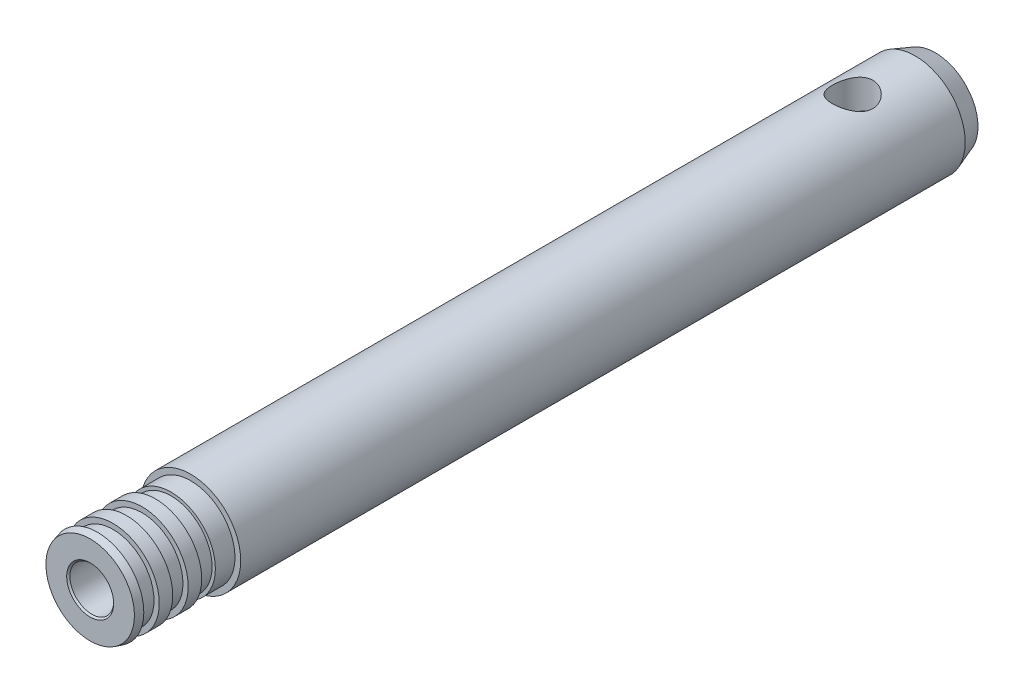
ISO-10303-21;
HEADER;
FILE_DESCRIPTION(('STEP AP214'),'2;1');
FILE_NAME('part.step','',(''),(''),'','','');
FILE_SCHEMA(('AUTOMOTIVE_DESIGN { 1 0 10303 214 1 1 1 1 }'));
ENDSEC;
DATA;
#1=APPLICATION_CONTEXT('core data for automotive mechanical design processes');
#2=APPLICATION_PROTOCOL_DEFINITION('international standard','automotive_design',2000,#1);
#3=PRODUCT_CONTEXT('',#1,'mechanical');
#4=PRODUCT('Part','Part','',(#3));
#5=PRODUCT_RELATED_PRODUCT_CATEGORY('part','',(#4));
#6=PRODUCT_DEFINITION_FORMATION('','',#4);
#7=PRODUCT_DEFINITION_CONTEXT('part definition',#1,'design');
#8=PRODUCT_DEFINITION('design','',#6,#7);
#9=PRODUCT_DEFINITION_SHAPE('','',#8);
#10=(LENGTH_UNIT() NAMED_UNIT(*) SI_UNIT(.MILLI.,.METRE.));
#11=(NAMED_UNIT(*) PLANE_ANGLE_UNIT() SI_UNIT($,.RADIAN.));
#12=(NAMED_UNIT(*) SI_UNIT($,.STERADIAN.) SOLID_ANGLE_UNIT());
#13=UNCERTAINTY_MEASURE_WITH_UNIT(LENGTH_MEASURE(1.E-05),#10,'distance_accuracy_value','');
#14=(GEOMETRIC_REPRESENTATION_CONTEXT(3) GLOBAL_UNCERTAINTY_ASSIGNED_CONTEXT((#13)) GLOBAL_UNIT_ASSIGNED_CONTEXT((#10,
#11,#12)) REPRESENTATION_CONTEXT('',''));
#15=CARTESIAN_POINT('',(0.,0.,0.));
#16=DIRECTION('',(0.,0.,1.));
#17=DIRECTION('',(1.,0.,0.));
#18=AXIS2_PLACEMENT_3D('',#15,#16,#17);
#19=CARTESIAN_POINT('',(0.,0.,66.7385));
#20=DIRECTION('',(0.,0.,1.));
#21=DIRECTION('',(1.,0.,0.));
#22=AXIS2_PLACEMENT_3D('',#19,#20,#21);
#23=PLANE('',#22);
#24=CARTESIAN_POINT('',(0.,0.,66.7385));
#25=DIRECTION('',(0.,0.,1.));
#26=DIRECTION('',(1.,0.,0.));
#27=AXIS2_PLACEMENT_3D('',#24,#25,#26);
#28=CIRCLE('',#27,1.8542);
#29=CARTESIAN_POINT('',(1.8542,0.,66.7385));
#30=VERTEX_POINT('',#29);
#31=EDGE_CURVE('E10',#30,#30,#28,.F.);
#32=ORIENTED_EDGE('',*,*,#31,.T.);
#33=EDGE_LOOP('',(#32));
#34=FACE_BOUND('',#33,.T.);
#35=CARTESIAN_POINT('',(0.,0.,66.7385));
#36=DIRECTION('',(0.,0.,1.));
#37=DIRECTION('',(1.,0.,0.));
#38=AXIS2_PLACEMENT_3D('',#35,#36,#37);
#39=CIRCLE('',#38,3.49471408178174);
#40=CARTESIAN_POINT('',(3.49471408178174,0.,66.7385));
#41=VERTEX_POINT('',#40);
#42=EDGE_CURVE('E172',#41,#41,#39,.T.);
#43=ORIENTED_EDGE('',*,*,#42,.T.);
#44=EDGE_LOOP('',(#43));
#45=FACE_BOUND('',#44,.T.);
#46=ADVANCED_FACE('F35',(#34,#45),#23,.T.);
#47=CARTESIAN_POINT('',(0.,0.,66.7385));
#48=DIRECTION('',(0.,0.,-1.));
#49=DIRECTION('',(-1.,0.,0.));
#50=AXIS2_PLACEMENT_3D('',#47,#48,#49);
#51=CYLINDRICAL_SURFACE('',#50,3.65125);
#52=CARTESIAN_POINT('',(0.,0.,62.6491));
#53=DIRECTION('',(0.,0.,1.));
#54=DIRECTION('',(1.,0.,0.));
#55=AXIS2_PLACEMENT_3D('',#52,#53,#54);
#56=CIRCLE('',#55,3.65125);
#57=CARTESIAN_POINT('',(3.65125,0.,62.6491));
#58=VERTEX_POINT('',#57);
#59=EDGE_CURVE('E197',#58,#58,#56,.T.);
#60=ORIENTED_EDGE('',*,*,#59,.F.);
#61=EDGE_LOOP('',(#60));
#62=FACE_BOUND('',#61,.T.);
#63=CARTESIAN_POINT('',(0.,0.,61.5823));
#64=DIRECTION('',(0.,0.,1.));
#65=DIRECTION('',(1.,0.,0.));
#66=AXIS2_PLACEMENT_3D('',#63,#64,#65);
#67=CIRCLE('',#66,3.65125);
#68=CARTESIAN_POINT('',(3.65125,0.,61.5823));
#69=VERTEX_POINT('',#68);
#70=EDGE_CURVE('E173',#69,#69,#67,.T.);
#71=ORIENTED_EDGE('',*,*,#70,.T.);
#72=EDGE_LOOP('',(#71));
#73=FACE_BOUND('',#72,.T.);
#74=ADVANCED_FACE('F74',(#62,#73),#51,.T.);
#75=CARTESIAN_POINT('',(0.,0.,64.9351));
#76=DIRECTION('',(0.,0.,1.));
#77=DIRECTION('',(1.,0.,0.));
#78=AXIS2_PLACEMENT_3D('',#75,#76,#77);
#79=CIRCLE('',#78,3.65125);
#80=CARTESIAN_POINT('',(3.65125,0.,64.9351));
#81=VERTEX_POINT('',#80);
#82=EDGE_CURVE('E188',#81,#81,#79,.T.);
#83=ORIENTED_EDGE('',*,*,#82,.F.);
#84=EDGE_LOOP('',(#83));
#85=FACE_BOUND('',#84,.T.);
#86=CARTESIAN_POINT('',(0.,0.,63.8683));
#87=DIRECTION('',(0.,0.,1.));
#88=DIRECTION('',(1.,0.,0.));
#89=AXIS2_PLACEMENT_3D('',#86,#87,#88);
#90=CIRCLE('',#89,3.65125);
#91=CARTESIAN_POINT('',(3.65125,0.,63.8683));
#92=VERTEX_POINT('',#91);
#93=EDGE_CURVE('E205',#92,#92,#90,.T.);
#94=ORIENTED_EDGE('',*,*,#93,.T.);
#95=EDGE_LOOP('',(#94));
#96=FACE_BOUND('',#95,.T.);
#97=ADVANCED_FACE('F116',(#85,#96),#51,.T.);
#98=CARTESIAN_POINT('',(0.,0.,58.801));
#99=DIRECTION('',(0.,0.,1.));
#100=DIRECTION('',(1.,0.,0.));
#101=AXIS2_PLACEMENT_3D('',#98,#99,#100);
#102=PLANE('',#101);
#103=CARTESIAN_POINT('',(0.,0.,58.801));
#104=DIRECTION('',(0.,0.,1.));
#105=DIRECTION('',(1.,0.,0.));
#106=AXIS2_PLACEMENT_3D('',#103,#104,#105);
#107=CIRCLE('',#106,3.9497);
#108=CARTESIAN_POINT('',(3.9497,0.,58.801));
#109=VERTEX_POINT('',#108);
#110=EDGE_CURVE('E225',#109,#109,#107,.T.);
#111=ORIENTED_EDGE('',*,*,#110,.T.);
#112=EDGE_LOOP('',(#111));
#113=FACE_BOUND('',#112,.T.);
#114=CARTESIAN_POINT('',(0.,0.,58.801));
#115=DIRECTION('',(0.,0.,1.));
#116=DIRECTION('',(1.,0.,0.));
#117=AXIS2_PLACEMENT_3D('',#114,#115,#116);
#118=CIRCLE('',#117,3.49885);
#119=CARTESIAN_POINT('',(3.49885,0.,58.801));
#120=VERTEX_POINT('',#119);
#121=EDGE_CURVE('E87',#120,#120,#118,.T.);
#122=ORIENTED_EDGE('',*,*,#121,.F.);
#123=EDGE_LOOP('',(#122));
#124=FACE_BOUND('',#123,.T.);
#125=ADVANCED_FACE('F241',(#113,#124),#102,.T.);
#126=CARTESIAN_POINT('',(0.,0.,0.));
#127=DIRECTION('',(0.,0.,1.));
#128=DIRECTION('',(1.,0.,0.));
#129=AXIS2_PLACEMENT_3D('',#126,#127,#128);
#130=PLANE('',#129);
#131=CARTESIAN_POINT('',(0.,0.,0.));
#132=DIRECTION('',(0.,0.,1.));
#133=DIRECTION('',(1.,0.,0.));
#134=AXIS2_PLACEMENT_3D('',#131,#132,#133);
#135=CIRCLE('',#134,1.85420000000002);
#136=CARTESIAN_POINT('',(1.85420000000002,0.,0.));
#137=VERTEX_POINT('',#136);
#138=EDGE_CURVE('E50',#137,#137,#135,.T.);
#139=ORIENTED_EDGE('',*,*,#138,.T.);
#140=EDGE_LOOP('',(#139));
#141=FACE_BOUND('',#140,.T.);
#142=CARTESIAN_POINT('',(0.,0.,0.));
#143=DIRECTION('',(0.,0.,1.));
#144=DIRECTION('',(1.,0.,0.));
#145=AXIS2_PLACEMENT_3D('',#142,#143,#144);
#146=CIRCLE('',#145,3.37189725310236);
#147=CARTESIAN_POINT('',(3.37189725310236,0.,0.));
#148=VERTEX_POINT('',#147);
#149=EDGE_CURVE('E231',#148,#148,#146,.F.);
#150=ORIENTED_EDGE('',*,*,#149,.T.);
#151=EDGE_LOOP('',(#150));
#152=FACE_BOUND('',#151,.T.);
#153=ADVANCED_FACE('F97',(#141,#152),#130,.F.);
#154=CARTESIAN_POINT('',(0.,0.,58.801));
#155=DIRECTION('',(0.,0.,-1.));
#156=DIRECTION('',(-1.,0.,0.));
#157=AXIS2_PLACEMENT_3D('',#154,#155,#156);
#158=CYLINDRICAL_SURFACE('',#157,3.9497);
#159=CARTESIAN_POINT('',(0.,-3.9497,8.128));
#160=CARTESIAN_POINT('',(0.0859072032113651,-3.94969379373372,8.12799165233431));
#161=CARTESIAN_POINT('',(0.171959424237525,-3.94686447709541,8.12103997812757));
#162=CARTESIAN_POINT('',(0.341634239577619,-3.93582174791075,8.09347576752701));
#163=CARTESIAN_POINT('',(0.425249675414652,-3.92759387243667,8.07282653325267));
#164=CARTESIAN_POINT('',(0.587321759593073,-3.90663994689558,8.0187457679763));
#165=CARTESIAN_POINT('',(0.665794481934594,-3.89392879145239,7.98535653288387));
#166=CARTESIAN_POINT('',(0.815952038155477,-3.86525593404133,7.90691342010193));
#167=CARTESIAN_POINT('',(0.887639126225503,-3.84929531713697,7.86186343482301));
#168=CARTESIAN_POINT('',(1.02574183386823,-3.81487477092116,7.75909014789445));
#169=CARTESIAN_POINT('',(1.09178866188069,-3.79633595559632,7.70089789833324));
#170=CARTESIAN_POINT('',(1.21349915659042,-3.75920296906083,7.57448221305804));
#171=CARTESIAN_POINT('',(1.26915762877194,-3.74060877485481,7.50625378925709));
#172=CARTESIAN_POINT('',(1.37103044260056,-3.70451941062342,7.35790075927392));
#173=CARTESIAN_POINT('',(1.41669392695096,-3.68711388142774,7.27737382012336));
#174=CARTESIAN_POINT('',(1.49366320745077,-3.65661417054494,7.1089725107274));
#175=CARTESIAN_POINT('',(1.52497599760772,-3.64351788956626,7.02110174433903));
#176=CARTESIAN_POINT('',(1.57085396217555,-3.62396846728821,6.84474741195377));
#177=CARTESIAN_POINT('',(1.58612636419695,-3.61723623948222,6.75647991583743));
#178=CARTESIAN_POINT('',(1.60169845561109,-3.61037009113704,6.57839806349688));
#179=CARTESIAN_POINT('',(1.6020057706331,-3.61023281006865,6.48858451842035));
#180=CARTESIAN_POINT('',(1.58817392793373,-3.61633455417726,6.31682965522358));
#181=CARTESIAN_POINT('',(1.57506906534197,-3.62211707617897,6.23478564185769));
#182=CARTESIAN_POINT('',(1.5365125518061,-3.63863909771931,6.07418032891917));
#183=CARTESIAN_POINT('',(1.51105868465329,-3.64937948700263,5.99561965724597));
#184=CARTESIAN_POINT('',(1.44803817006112,-3.67484513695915,5.84228805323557));
#185=CARTESIAN_POINT('',(1.4102318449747,-3.68964823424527,5.76762913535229));
#186=CARTESIAN_POINT('',(1.32374820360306,-3.72155095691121,5.62543577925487));
#187=CARTESIAN_POINT('',(1.27506673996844,-3.73865145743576,5.55790407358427));
#188=CARTESIAN_POINT('',(1.16366940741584,-3.77487669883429,5.42623466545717));
#189=CARTESIAN_POINT('',(1.10014570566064,-3.7940543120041,5.36279310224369));
#190=CARTESIAN_POINT('',(0.963160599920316,-3.83112027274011,5.24723733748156));
#191=CARTESIAN_POINT('',(0.889697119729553,-3.84900834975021,5.19512550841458));
#192=CARTESIAN_POINT('',(0.732900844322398,-3.88194880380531,5.10276298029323));
#193=CARTESIAN_POINT('',(0.649395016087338,-3.8969347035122,5.06278058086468));
#194=CARTESIAN_POINT('',(0.476081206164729,-3.92187746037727,4.99767217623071));
#195=CARTESIAN_POINT('',(0.386276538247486,-3.93183693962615,4.97253842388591));
#196=CARTESIAN_POINT('',(0.208744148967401,-3.94512320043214,4.93926345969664));
#197=CARTESIAN_POINT('',(0.121218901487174,-3.94881444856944,4.93018711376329));
#198=CARTESIAN_POINT('',(-0.0541738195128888,-3.95030102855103,4.92651531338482));
#199=CARTESIAN_POINT('',(-0.142041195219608,-3.94809793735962,4.93191598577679));
#200=CARTESIAN_POINT('',(-0.311343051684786,-3.93828134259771,4.95636265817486));
#201=CARTESIAN_POINT('',(-0.39288695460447,-3.93092326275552,4.97476480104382));
#202=CARTESIAN_POINT('',(-0.551650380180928,-3.91180391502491,5.0238099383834));
#203=CARTESIAN_POINT('',(-0.628869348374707,-3.90004208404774,5.05445449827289));
#204=CARTESIAN_POINT('',(-0.77946617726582,-3.87280276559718,5.12811590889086));
#205=CARTESIAN_POINT('',(-0.852652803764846,-3.8572221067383,5.17148435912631));
#206=CARTESIAN_POINT('',(-0.990968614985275,-3.82402651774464,5.26897361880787));
#207=CARTESIAN_POINT('',(-1.05609450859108,-3.80641076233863,5.32309879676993));
#208=CARTESIAN_POINT('',(-1.18106678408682,-3.76958080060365,5.44485799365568));
#209=CARTESIAN_POINT('',(-1.24025755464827,-3.75033910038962,5.51315835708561));
#210=CARTESIAN_POINT('',(-1.34650508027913,-3.7135191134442,5.65905315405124));
#211=CARTESIAN_POINT('',(-1.39355961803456,-3.69594113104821,5.73664928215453));
#212=CARTESIAN_POINT('',(-1.47455721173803,-3.66438675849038,5.90022890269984));
#213=CARTESIAN_POINT('',(-1.50835029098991,-3.65045212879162,5.98629529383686));
#214=CARTESIAN_POINT('',(-1.56069449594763,-3.62838599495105,6.16363400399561));
#215=CARTESIAN_POINT('',(-1.57925726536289,-3.62025005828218,6.25490228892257));
#216=CARTESIAN_POINT('',(-1.59948786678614,-3.61135424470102,6.43282404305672));
#217=CARTESIAN_POINT('',(-1.60229738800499,-3.61009609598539,6.51932352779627));
#218=CARTESIAN_POINT('',(-1.59395491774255,-3.613787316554,6.69150282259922));
#219=CARTESIAN_POINT('',(-1.58280480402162,-3.61873585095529,6.77718274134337));
#220=CARTESIAN_POINT('',(-1.54780026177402,-3.63383844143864,6.94163250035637));
#221=CARTESIAN_POINT('',(-1.52449361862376,-3.64376738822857,7.0205415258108));
#222=CARTESIAN_POINT('',(-1.46635695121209,-3.66754803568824,7.17335691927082));
#223=CARTESIAN_POINT('',(-1.43152372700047,-3.68140082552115,7.24726189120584));
#224=CARTESIAN_POINT('',(-1.34898389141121,-3.71246847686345,7.3926572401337));
#225=CARTESIAN_POINT('',(-1.30064632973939,-3.72983203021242,7.46375711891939));
#226=CARTESIAN_POINT('',(-1.19338042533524,-3.76552325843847,7.59719438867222));
#227=CARTESIAN_POINT('',(-1.13444874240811,-3.7838512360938,7.65952900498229));
#228=CARTESIAN_POINT('',(-1.00295588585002,-3.82088680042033,7.77796929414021));
#229=CARTESIAN_POINT('',(-0.92974483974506,-3.83953709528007,7.83337464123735));
#230=CARTESIAN_POINT('',(-0.774361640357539,-3.87386302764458,7.93113437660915));
#231=CARTESIAN_POINT('',(-0.69218537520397,-3.88953729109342,7.97348274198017));
#232=CARTESIAN_POINT('',(-0.522646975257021,-3.9158906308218,8.04295387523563));
#233=CARTESIAN_POINT('',(-0.435405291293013,-3.9266548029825,8.0703377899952));
#234=CARTESIAN_POINT('',(-0.257193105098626,-3.9423240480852,8.10981132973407));
#235=CARTESIAN_POINT('',(-0.166235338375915,-3.94724763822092,8.12194929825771));
#236=CARTESIAN_POINT('',(-0.0500307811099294,-3.94946412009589,8.12741583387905));
#237=CARTESIAN_POINT('',(-0.0250215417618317,-3.94970180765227,8.12800243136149));
#238=CARTESIAN_POINT('',(0.,-3.9497,8.128));
#239=B_SPLINE_CURVE_WITH_KNOTS('',3,(#159,#160,#161,#162,#163,#164,#165,#166,#167,#168,#169,
#170,#171,#172,#173,#174,#175,#176,#177,#178,#179,#180,#181,#182,#183,#184,#185,#186,#187,#188,
#189,#190,#191,#192,#193,#194,#195,#196,#197,#198,#199,#200,#201,#202,#203,#204,#205,#206,#207,
#208,#209,#210,#211,#212,#213,#214,#215,#216,#217,#218,#219,#220,#221,#222,#223,#224,#225,#226,
#227,#228,#229,#230,#231,#232,#233,#234,#235,#236,#237,#238),.UNSPECIFIED.,.T.,.F.,(4,2,2,2,2,2,
2,2,2,2,2,2,2,2,2,2,2,2,2,2,2,2,2,2,2,2,2,2,2,2,2,2,2,2,2,2,2,2,2,4),(0.,0.257653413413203,
0.51599992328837,0.77349610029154,1.03090643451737,1.29959967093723,1.56842690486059,
1.84959533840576,2.13062659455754,2.39866765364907,2.66657212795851,2.91526668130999,
3.16400588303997,3.41789060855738,3.67187232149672,3.94603656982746,4.22025817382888,
4.50016486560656,4.779925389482,5.04277882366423,5.30556194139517,5.55616889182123,
5.80680789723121,6.06515710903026,6.32361145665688,6.59955761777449,6.87555415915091,
7.15458777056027,7.43340785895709,7.69173089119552,7.95001917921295,8.19756286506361,
8.44517533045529,8.70719063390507,8.9692886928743,9.2490041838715,9.52884850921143,
9.80363915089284,10.0775562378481,10.1526010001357),.UNSPECIFIED.);
#240=CARTESIAN_POINT('',(0.,-3.9497,8.128));
#241=VERTEX_POINT('',#240);
#242=EDGE_CURVE('E86',#241,#241,#239,.T.);
#243=ORIENTED_EDGE('',*,*,#242,.T.);
#244=EDGE_LOOP('',(#243));
#245=FACE_BOUND('',#244,.T.);
#246=CARTESIAN_POINT('',(0.,3.9497,8.128));
#247=CARTESIAN_POINT('',(-0.0859072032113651,3.94969379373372,8.12799165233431));
#248=CARTESIAN_POINT('',(-0.171959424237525,3.94686447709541,8.12103997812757));
#249=CARTESIAN_POINT('',(-0.341634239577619,3.93582174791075,8.09347576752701));
#250=CARTESIAN_POINT('',(-0.425249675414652,3.92759387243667,8.07282653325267));
#251=CARTESIAN_POINT('',(-0.587321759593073,3.90663994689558,8.0187457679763));
#252=CARTESIAN_POINT('',(-0.665794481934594,3.89392879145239,7.98535653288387));
#253=CARTESIAN_POINT('',(-0.815952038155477,3.86525593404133,7.90691342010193));
#254=CARTESIAN_POINT('',(-0.887639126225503,3.84929531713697,7.86186343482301));
#255=CARTESIAN_POINT('',(-1.02574183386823,3.81487477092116,7.75909014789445));
#256=CARTESIAN_POINT('',(-1.09178866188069,3.79633595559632,7.70089789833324));
#257=CARTESIAN_POINT('',(-1.21349915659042,3.75920296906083,7.57448221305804));
#258=CARTESIAN_POINT('',(-1.26915762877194,3.74060877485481,7.50625378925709));
#259=CARTESIAN_POINT('',(-1.37103044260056,3.70451941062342,7.35790075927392));
#260=CARTESIAN_POINT('',(-1.41669392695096,3.68711388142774,7.27737382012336));
#261=CARTESIAN_POINT('',(-1.49366320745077,3.65661417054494,7.1089725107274));
#262=CARTESIAN_POINT('',(-1.52497599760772,3.64351788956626,7.02110174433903));
#263=CARTESIAN_POINT('',(-1.57085396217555,3.62396846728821,6.84474741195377));
#264=CARTESIAN_POINT('',(-1.58612636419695,3.61723623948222,6.75647991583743));
#265=CARTESIAN_POINT('',(-1.60169845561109,3.61037009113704,6.57839806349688));
#266=CARTESIAN_POINT('',(-1.6020057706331,3.61023281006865,6.48858451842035));
#267=CARTESIAN_POINT('',(-1.58817392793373,3.61633455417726,6.31682965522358));
#268=CARTESIAN_POINT('',(-1.57506906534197,3.62211707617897,6.23478564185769));
#269=CARTESIAN_POINT('',(-1.5365125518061,3.63863909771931,6.07418032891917));
#270=CARTESIAN_POINT('',(-1.51105868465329,3.64937948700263,5.99561965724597));
#271=CARTESIAN_POINT('',(-1.44803817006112,3.67484513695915,5.84228805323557));
#272=CARTESIAN_POINT('',(-1.4102318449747,3.68964823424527,5.76762913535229));
#273=CARTESIAN_POINT('',(-1.32374820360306,3.72155095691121,5.62543577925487));
#274=CARTESIAN_POINT('',(-1.27506673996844,3.73865145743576,5.55790407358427));
#275=CARTESIAN_POINT('',(-1.16366940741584,3.77487669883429,5.42623466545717));
#276=CARTESIAN_POINT('',(-1.10014570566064,3.7940543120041,5.36279310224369));
#277=CARTESIAN_POINT('',(-0.963160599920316,3.83112027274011,5.24723733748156));
#278=CARTESIAN_POINT('',(-0.889697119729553,3.84900834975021,5.19512550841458));
#279=CARTESIAN_POINT('',(-0.732900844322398,3.88194880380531,5.10276298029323));
#280=CARTESIAN_POINT('',(-0.649395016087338,3.8969347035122,5.06278058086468));
#281=CARTESIAN_POINT('',(-0.476081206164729,3.92187746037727,4.99767217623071));
#282=CARTESIAN_POINT('',(-0.386276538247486,3.93183693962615,4.97253842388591));
#283=CARTESIAN_POINT('',(-0.208744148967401,3.94512320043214,4.93926345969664));
#284=CARTESIAN_POINT('',(-0.121218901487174,3.94881444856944,4.93018711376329));
#285=CARTESIAN_POINT('',(0.0541738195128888,3.95030102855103,4.92651531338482));
#286=CARTESIAN_POINT('',(0.142041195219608,3.94809793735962,4.93191598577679));
#287=CARTESIAN_POINT('',(0.311343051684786,3.93828134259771,4.95636265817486));
#288=CARTESIAN_POINT('',(0.39288695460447,3.93092326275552,4.97476480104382));
#289=CARTESIAN_POINT('',(0.551650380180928,3.91180391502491,5.0238099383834));
#290=CARTESIAN_POINT('',(0.628869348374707,3.90004208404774,5.05445449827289));
#291=CARTESIAN_POINT('',(0.77946617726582,3.87280276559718,5.12811590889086));
#292=CARTESIAN_POINT('',(0.852652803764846,3.8572221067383,5.17148435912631));
#293=CARTESIAN_POINT('',(0.990968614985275,3.82402651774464,5.26897361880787));
#294=CARTESIAN_POINT('',(1.05609450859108,3.80641076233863,5.32309879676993));
#295=CARTESIAN_POINT('',(1.18106678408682,3.76958080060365,5.44485799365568));
#296=CARTESIAN_POINT('',(1.24025755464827,3.75033910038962,5.51315835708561));
#297=CARTESIAN_POINT('',(1.34650508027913,3.7135191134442,5.65905315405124));
#298=CARTESIAN_POINT('',(1.39355961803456,3.69594113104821,5.73664928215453));
#299=CARTESIAN_POINT('',(1.47455721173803,3.66438675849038,5.90022890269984));
#300=CARTESIAN_POINT('',(1.50835029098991,3.65045212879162,5.98629529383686));
#301=CARTESIAN_POINT('',(1.56069449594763,3.62838599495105,6.16363400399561));
#302=CARTESIAN_POINT('',(1.57925726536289,3.62025005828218,6.25490228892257));
#303=CARTESIAN_POINT('',(1.59948786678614,3.61135424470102,6.43282404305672));
#304=CARTESIAN_POINT('',(1.60229738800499,3.61009609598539,6.51932352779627));
#305=CARTESIAN_POINT('',(1.59395491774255,3.613787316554,6.69150282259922));
#306=CARTESIAN_POINT('',(1.58280480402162,3.61873585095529,6.77718274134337));
#307=CARTESIAN_POINT('',(1.54780026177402,3.63383844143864,6.94163250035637));
#308=CARTESIAN_POINT('',(1.52449361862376,3.64376738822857,7.0205415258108));
#309=CARTESIAN_POINT('',(1.46635695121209,3.66754803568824,7.17335691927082));
#310=CARTESIAN_POINT('',(1.43152372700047,3.68140082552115,7.24726189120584));
#311=CARTESIAN_POINT('',(1.34898389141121,3.71246847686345,7.3926572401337));
#312=CARTESIAN_POINT('',(1.30064632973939,3.72983203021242,7.46375711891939));
#313=CARTESIAN_POINT('',(1.19338042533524,3.76552325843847,7.59719438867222));
#314=CARTESIAN_POINT('',(1.13444874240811,3.7838512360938,7.65952900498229));
#315=CARTESIAN_POINT('',(1.00295588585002,3.82088680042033,7.77796929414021));
#316=CARTESIAN_POINT('',(0.92974483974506,3.83953709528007,7.83337464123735));
#317=CARTESIAN_POINT('',(0.774361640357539,3.87386302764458,7.93113437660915));
#318=CARTESIAN_POINT('',(0.69218537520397,3.88953729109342,7.97348274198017));
#319=CARTESIAN_POINT('',(0.522646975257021,3.9158906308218,8.04295387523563));
#320=CARTESIAN_POINT('',(0.435405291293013,3.9266548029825,8.0703377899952));
#321=CARTESIAN_POINT('',(0.257193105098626,3.9423240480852,8.10981132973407));
#322=CARTESIAN_POINT('',(0.166235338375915,3.94724763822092,8.12194929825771));
#323=CARTESIAN_POINT('',(0.0500307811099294,3.94946412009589,8.12741583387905));
#324=CARTESIAN_POINT('',(0.0250215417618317,3.94970180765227,8.12800243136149));
#325=CARTESIAN_POINT('',(0.,3.9497,8.128));
#326=B_SPLINE_CURVE_WITH_KNOTS('',3,(#246,#247,#248,#249,#250,#251,#252,#253,#254,#255,#256,
#257,#258,#259,#260,#261,#262,#263,#264,#265,#266,#267,#268,#269,#270,#271,#272,#273,#274,#275,
#276,#277,#278,#279,#280,#281,#282,#283,#284,#285,#286,#287,#288,#289,#290,#291,#292,#293,#294,
#295,#296,#297,#298,#299,#300,#301,#302,#303,#304,#305,#306,#307,#308,#309,#310,#311,#312,#313,
#314,#315,#316,#317,#318,#319,#320,#321,#322,#323,#324,#325),.UNSPECIFIED.,.T.,.F.,(4,2,2,2,2,2,
2,2,2,2,2,2,2,2,2,2,2,2,2,2,2,2,2,2,2,2,2,2,2,2,2,2,2,2,2,2,2,2,2,4),(0.,0.257653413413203,
0.51599992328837,0.77349610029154,1.03090643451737,1.29959967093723,1.56842690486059,
1.84959533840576,2.13062659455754,2.39866765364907,2.66657212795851,2.91526668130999,
3.16400588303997,3.41789060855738,3.67187232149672,3.94603656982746,4.22025817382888,
4.50016486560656,4.779925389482,5.04277882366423,5.30556194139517,5.55616889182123,
5.80680789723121,6.06515710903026,6.32361145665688,6.59955761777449,6.87555415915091,
7.15458777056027,7.43340785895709,7.69173089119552,7.95001917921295,8.19756286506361,
8.44517533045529,8.70719063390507,8.9692886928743,9.2490041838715,9.52884850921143,
9.80363915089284,10.0775562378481,10.1526010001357),.UNSPECIFIED.);
#327=CARTESIAN_POINT('',(0.,3.9497,8.128));
#328=VERTEX_POINT('',#327);
#329=EDGE_CURVE('E60',#328,#328,#326,.T.);
#330=ORIENTED_EDGE('',*,*,#329,.T.);
#331=EDGE_LOOP('',(#330));
#332=FACE_BOUND('',#331,.T.);
#333=CARTESIAN_POINT('',(0.,0.,1.58750000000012));
#334=DIRECTION('',(0.,0.,1.));
#335=DIRECTION('',(1.,0.,0.));
#336=AXIS2_PLACEMENT_3D('',#333,#334,#335);
#337=CIRCLE('',#336,3.9497);
#338=CARTESIAN_POINT('',(3.9497,0.,1.58750000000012));
#339=VERTEX_POINT('',#338);
#340=EDGE_CURVE('E227',#339,#339,#337,.T.);
#341=ORIENTED_EDGE('',*,*,#340,.T.);
#342=EDGE_LOOP('',(#341));
#343=FACE_BOUND('',#342,.T.);
#344=ORIENTED_EDGE('',*,*,#110,.F.);
#345=EDGE_LOOP('',(#344));
#346=FACE_BOUND('',#345,.T.);
#347=ADVANCED_FACE('F92',(#245,#332,#343,#346),#158,.T.);
#348=CARTESIAN_POINT('',(0.,0.,58.801));
#349=DIRECTION('',(0.,0.,-1.));
#350=DIRECTION('',(-1.,0.,0.));
#351=AXIS2_PLACEMENT_3D('',#348,#349,#350);
#352=CYLINDRICAL_SURFACE('',#351,1.7272);
#353=CARTESIAN_POINT('',(0.,0.,66.6115));
#354=DIRECTION('',(0.,0.,1.));
#355=DIRECTION('',(1.,0.,0.));
#356=AXIS2_PLACEMENT_3D('',#353,#354,#355);
#357=CIRCLE('',#356,1.7272);
#358=CARTESIAN_POINT('',(1.7272,0.,66.6115));
#359=VERTEX_POINT('',#358);
#360=EDGE_CURVE('E42',#359,#359,#357,.T.);
#361=ORIENTED_EDGE('',*,*,#360,.T.);
#362=EDGE_LOOP('',(#361));
#363=FACE_BOUND('',#362,.T.);
#364=CARTESIAN_POINT('',(0.,-1.7272,8.128));
#365=CARTESIAN_POINT('',(0.0734228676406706,-1.72719540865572,8.12799536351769));
#366=CARTESIAN_POINT('',(0.146883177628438,-1.72247698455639,8.12290503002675));
#367=CARTESIAN_POINT('',(0.291310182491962,-1.70401772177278,8.10295089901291));
#368=CARTESIAN_POINT('',(0.362274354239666,-1.69026801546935,8.08807749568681));
#369=CARTESIAN_POINT('',(0.499231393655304,-1.65498045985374,8.04977389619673));
#370=CARTESIAN_POINT('',(0.565253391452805,-1.63349345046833,8.02639954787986));
#371=CARTESIAN_POINT('',(0.691653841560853,-1.58412423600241,7.97241954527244));
#372=CARTESIAN_POINT('',(0.752029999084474,-1.55623944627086,7.94181096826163));
#373=CARTESIAN_POINT('',(0.889734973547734,-1.4831960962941,7.86106479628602));
#374=CARTESIAN_POINT('',(0.964074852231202,-1.43560744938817,7.80803058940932));
#375=CARTESIAN_POINT('',(1.10041011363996,-1.33401009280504,7.69294425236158));
#376=CARTESIAN_POINT('',(1.16237607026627,-1.27998655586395,7.63087121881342));
#377=CARTESIAN_POINT('',(1.2757068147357,-1.1671819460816,7.49774959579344));
#378=CARTESIAN_POINT('',(1.32676813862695,-1.10831574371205,7.4265155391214));
#379=CARTESIAN_POINT('',(1.3941755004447,-1.02022875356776,7.31423752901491));
#380=CARTESIAN_POINT('',(1.4151045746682,-0.990918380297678,7.27593031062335));
#381=CARTESIAN_POINT('',(1.45394020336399,-0.932999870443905,7.19731422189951));
#382=CARTESIAN_POINT('',(1.47184820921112,-0.90439140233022,7.15700632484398));
#383=CARTESIAN_POINT('',(1.50408921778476,-0.849654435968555,7.07534320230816));
#384=CARTESIAN_POINT('',(1.51851498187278,-0.823476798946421,7.03405795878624));
#385=CARTESIAN_POINT('',(1.54431679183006,-0.774002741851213,6.94879776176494));
#386=CARTESIAN_POINT('',(1.55569172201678,-0.750707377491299,6.90482183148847));
#387=CARTESIAN_POINT('',(1.57346993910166,-0.712589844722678,6.82080559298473));
#388=CARTESIAN_POINT('',(1.58037260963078,-0.69701224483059,6.78122586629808));
#389=CARTESIAN_POINT('',(1.59126615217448,-0.671778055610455,6.69987137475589));
#390=CARTESIAN_POINT('',(1.595267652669,-0.662099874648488,6.65810522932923));
#391=CARTESIAN_POINT('',(1.59952778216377,-0.651734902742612,6.58047270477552));
#392=CARTESIAN_POINT('',(1.60030655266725,-0.649800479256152,6.54480865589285));
#393=CARTESIAN_POINT('',(1.59947361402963,-0.651847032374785,6.4736828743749));
#394=CARTESIAN_POINT('',(1.59786140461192,-0.655829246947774,6.438221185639));
#395=CARTESIAN_POINT('',(1.59158740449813,-0.670933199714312,6.35791369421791));
#396=CARTESIAN_POINT('',(1.58614944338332,-0.683852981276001,6.3134811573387));
#397=CARTESIAN_POINT('',(1.57209048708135,-0.715575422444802,6.22723184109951));
#398=CARTESIAN_POINT('',(1.56345476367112,-0.734405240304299,6.18542822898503));
#399=CARTESIAN_POINT('',(1.54346401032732,-0.775540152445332,6.10437614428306));
#400=CARTESIAN_POINT('',(1.53211202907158,-0.797841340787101,6.06512486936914));
#401=CARTESIAN_POINT('',(1.5069022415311,-0.844495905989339,5.98868140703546));
#402=CARTESIAN_POINT('',(1.49304189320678,-0.868851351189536,5.95149135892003));
#403=CARTESIAN_POINT('',(1.44784040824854,-0.943583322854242,5.84245363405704));
#404=CARTESIAN_POINT('',(1.41289517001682,-0.995589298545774,5.77320171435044));
#405=CARTESIAN_POINT('',(1.32768442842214,-1.10731460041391,5.63072429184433));
#406=CARTESIAN_POINT('',(1.27592314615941,-1.16704574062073,5.55840735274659));
#407=CARTESIAN_POINT('',(1.15943797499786,-1.28283090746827,5.42177563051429));
#408=CARTESIAN_POINT('',(1.09473511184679,-1.33889070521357,5.35744813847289));
#409=CARTESIAN_POINT('',(0.965272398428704,-1.43410798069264,5.24974115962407));
#410=CARTESIAN_POINT('',(0.902792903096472,-1.47446464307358,5.20469477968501));
#411=CARTESIAN_POINT('',(0.769043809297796,-1.54842162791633,5.12275944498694));
#412=CARTESIAN_POINT('',(0.697783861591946,-1.58202926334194,5.08586165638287));
#413=CARTESIAN_POINT('',(0.560257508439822,-1.63517473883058,5.02777064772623));
#414=CARTESIAN_POINT('',(0.495227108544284,-1.65613661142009,5.00496989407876));
#415=CARTESIAN_POINT('',(0.360902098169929,-1.69049186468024,4.96768082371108));
#416=CARTESIAN_POINT('',(0.291610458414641,-1.70389045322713,4.95318678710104));
#417=CARTESIAN_POINT('',(0.150234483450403,-1.72213530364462,4.93346420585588));
#418=CARTESIAN_POINT('',(0.0781381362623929,-1.7269393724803,4.92828137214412));
#419=CARTESIAN_POINT('',(-0.0661201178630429,-1.7274397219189,4.92774119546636));
#420=CARTESIAN_POINT('',(-0.13828201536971,-1.72313715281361,4.93238261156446));
#421=CARTESIAN_POINT('',(-0.274616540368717,-1.70650200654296,4.95036266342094));
#422=CARTESIAN_POINT('',(-0.338969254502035,-1.69483243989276,4.96298331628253));
#423=CARTESIAN_POINT('',(-0.464198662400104,-1.66489979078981,4.99544968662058));
#424=CARTESIAN_POINT('',(-0.525074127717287,-1.64663439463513,5.01529793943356));
#425=CARTESIAN_POINT('',(-0.661110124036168,-1.5977823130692,5.06860341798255));
#426=CARTESIAN_POINT('',(-0.734616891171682,-1.56512341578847,5.10438273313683));
#427=CARTESIAN_POINT('',(-0.872756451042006,-1.49252771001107,5.18460605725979));
#428=CARTESIAN_POINT('',(-0.937372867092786,-1.45257777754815,5.22906570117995));
#429=CARTESIAN_POINT('',(-1.07763560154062,-1.35334759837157,5.34089211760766));
#430=CARTESIAN_POINT('',(-1.14973761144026,-1.29207225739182,5.41094590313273));
#431=CARTESIAN_POINT('',(-1.24608590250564,-1.1968878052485,5.52315762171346));
#432=CARTESIAN_POINT('',(-1.27626697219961,-1.16456899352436,5.56180651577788));
#433=CARTESIAN_POINT('',(-1.33278953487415,-1.09943266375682,5.64140527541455));
#434=CARTESIAN_POINT('',(-1.35913230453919,-1.06661531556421,5.68235436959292));
#435=CARTESIAN_POINT('',(-1.41995049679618,-0.985202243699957,5.7870537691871));
#436=CARTESIAN_POINT('',(-1.45216149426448,-0.936684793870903,5.85221847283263));
#437=CARTESIAN_POINT('',(-1.49412484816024,-0.866922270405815,5.95447036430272));
#438=CARTESIAN_POINT('',(-1.507044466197,-0.844190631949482,5.98926978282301));
#439=CARTESIAN_POINT('',(-1.53069253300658,-0.800507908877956,6.06067161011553));
#440=CARTESIAN_POINT('',(-1.54142280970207,-0.779555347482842,6.09727248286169));
#441=CARTESIAN_POINT('',(-1.56023121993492,-0.741175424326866,6.17148953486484));
#442=CARTESIAN_POINT('',(-1.5683798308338,-0.723660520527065,6.20904139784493));
#443=CARTESIAN_POINT('',(-1.58213223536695,-0.69307978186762,6.28635736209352));
#444=CARTESIAN_POINT('',(-1.5877414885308,-0.68000441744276,6.32611650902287));
#445=CARTESIAN_POINT('',(-1.59533334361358,-0.661977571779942,6.40113151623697));
#446=CARTESIAN_POINT('',(-1.59774973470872,-0.656067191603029,6.43610282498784));
#447=CARTESIAN_POINT('',(-1.60024430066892,-0.649962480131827,6.506609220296));
#448=CARTESIAN_POINT('',(-1.60032558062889,-0.649760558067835,6.54214349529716));
#449=CARTESIAN_POINT('',(-1.5981504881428,-0.65508817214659,6.61260279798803));
#450=CARTESIAN_POINT('',(-1.59589913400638,-0.660605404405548,6.6475289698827));
#451=CARTESIAN_POINT('',(-1.58927945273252,-0.676375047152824,6.71610293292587));
#452=CARTESIAN_POINT('',(-1.58490673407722,-0.686637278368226,6.74974791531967));
#453=CARTESIAN_POINT('',(-1.56981607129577,-0.720740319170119,6.84340721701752));
#454=CARTESIAN_POINT('',(-1.55686444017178,-0.748706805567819,6.90151380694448));
#455=CARTESIAN_POINT('',(-1.52575103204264,-0.810254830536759,7.01325391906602));
#456=CARTESIAN_POINT('',(-1.50756338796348,-0.84386389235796,7.06686348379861));
#457=CARTESIAN_POINT('',(-1.46715929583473,-0.912241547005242,7.16855596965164));
#458=CARTESIAN_POINT('',(-1.44511965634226,-0.946919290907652,7.21677079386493));
#459=CARTESIAN_POINT('',(-1.39666420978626,-1.01704196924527,7.31037313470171));
#460=CARTESIAN_POINT('',(-1.37024500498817,-1.05248748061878,7.35575841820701));
#461=CARTESIAN_POINT('',(-1.28442313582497,-1.15831370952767,7.48783669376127));
#462=CARTESIAN_POINT('',(-1.21836242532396,-1.2283542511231,7.57068622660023));
#463=CARTESIAN_POINT('',(-1.08650659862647,-1.34478752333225,7.70529291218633));
#464=CARTESIAN_POINT('',(-1.02472278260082,-1.39273229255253,7.75966102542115));
#465=CARTESIAN_POINT('',(-0.890476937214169,-1.4821397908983,7.85993217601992));
#466=CARTESIAN_POINT('',(-0.818032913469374,-1.52361321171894,7.90584919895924));
#467=CARTESIAN_POINT('',(-0.679096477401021,-1.58955197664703,7.97838931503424));
#468=CARTESIAN_POINT('',(-0.614495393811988,-1.61576074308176,8.00703895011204));
#469=CARTESIAN_POINT('',(-0.479791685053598,-1.66073360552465,8.05604200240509));
#470=CARTESIAN_POINT('',(-0.409697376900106,-1.67950870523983,8.07640768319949));
#471=CARTESIAN_POINT('',(-0.282936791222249,-1.70478475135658,8.10378267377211));
#472=CARTESIAN_POINT('',(-0.227073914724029,-1.71314821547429,8.11282243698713));
#473=CARTESIAN_POINT('',(-0.114148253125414,-1.72435768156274,8.12493296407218));
#474=CARTESIAN_POINT('',(-0.0570854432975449,-1.72720356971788,8.12800360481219));
#475=CARTESIAN_POINT('',(0.,-1.7272,8.128));
#476=B_SPLINE_CURVE_WITH_KNOTS('',3,(#364,#365,#366,#367,#368,#369,#370,#371,#372,#373,#374,
#375,#376,#377,#378,#379,#380,#381,#382,#383,#384,#385,#386,#387,#388,#389,#390,#391,#392,#393,
#394,#395,#396,#397,#398,#399,#400,#401,#402,#403,#404,#405,#406,#407,#408,#409,#410,#411,#412,
#413,#414,#415,#416,#417,#418,#419,#420,#421,#422,#423,#424,#425,#426,#427,#428,#429,#430,#431,
#432,#433,#434,#435,#436,#437,#438,#439,#440,#441,#442,#443,#444,#445,#446,#447,#448,#449,#450,
#451,#452,#453,#454,#455,#456,#457,#458,#459,#460,#461,#462,#463,#464,#465,#466,#467,#468,#469,
#470,#471,#472,#473,#474,#475),.UNSPECIFIED.,.T.,.F.,(4,2,2,2,2,2,2,2,2,2,2,2,2,2,2,2,2,2,2,2,2,
2,2,2,2,2,2,2,2,2,2,2,2,2,2,2,2,2,2,2,2,2,2,2,2,2,2,2,2,2,2,2,2,2,2,4),(0.,0.220021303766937,
0.440258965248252,0.659075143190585,0.877979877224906,1.18520824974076,1.49315875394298,
1.80880141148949,1.96644394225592,2.12401052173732,2.27674700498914,2.42953926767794,
2.55842829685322,2.68684271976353,2.79345380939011,2.90008720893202,3.03903889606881,
3.17863869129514,3.3180825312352,3.457668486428,3.73706263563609,4.05746313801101,
4.37734726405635,4.63731944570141,4.89700839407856,5.11220768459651,5.32725861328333,
5.5433624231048,5.75943893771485,5.95840106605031,6.15743305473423,6.42008534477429,
6.68321516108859,7.03439346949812,7.21045416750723,7.38645617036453,7.64794312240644,
7.77843776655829,7.90882300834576,8.03525961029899,8.16142307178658,8.26759767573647,
8.37363108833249,8.47943685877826,8.58546260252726,8.7816554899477,8.97883475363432,
9.16861423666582,9.35854164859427,9.73749357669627,10.0223003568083,10.3066314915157,
10.5318800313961,10.7567938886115,10.9278544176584,11.0989184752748),.UNSPECIFIED.);
#477=CARTESIAN_POINT('',(0.,-1.7272,8.128));
#478=VERTEX_POINT('',#477);
#479=EDGE_CURVE('E53',#478,#478,#476,.T.);
#480=ORIENTED_EDGE('',*,*,#479,.F.);
#481=EDGE_LOOP('',(#480));
#482=FACE_BOUND('',#481,.T.);
#483=CARTESIAN_POINT('',(0.,1.7272,8.128));
#484=CARTESIAN_POINT('',(-0.0734228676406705,1.72719540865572,8.12799536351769));
#485=CARTESIAN_POINT('',(-0.146883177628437,1.72247698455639,8.12290503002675));
#486=CARTESIAN_POINT('',(-0.291310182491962,1.70401772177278,8.10295089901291));
#487=CARTESIAN_POINT('',(-0.362274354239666,1.69026801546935,8.08807749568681));
#488=CARTESIAN_POINT('',(-0.499231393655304,1.65498045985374,8.04977389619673));
#489=CARTESIAN_POINT('',(-0.565253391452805,1.63349345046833,8.02639954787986));
#490=CARTESIAN_POINT('',(-0.691653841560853,1.58412423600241,7.97241954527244));
#491=CARTESIAN_POINT('',(-0.752029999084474,1.55623944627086,7.94181096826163));
#492=CARTESIAN_POINT('',(-0.889734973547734,1.4831960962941,7.86106479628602));
#493=CARTESIAN_POINT('',(-0.964074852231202,1.43560744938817,7.80803058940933));
#494=CARTESIAN_POINT('',(-1.10041011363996,1.33401009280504,7.69294425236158));
#495=CARTESIAN_POINT('',(-1.16237607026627,1.27998655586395,7.63087121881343));
#496=CARTESIAN_POINT('',(-1.2757068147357,1.1671819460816,7.49774959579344));
#497=CARTESIAN_POINT('',(-1.32676813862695,1.10831574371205,7.4265155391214));
#498=CARTESIAN_POINT('',(-1.3941755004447,1.02022875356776,7.31423752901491));
#499=CARTESIAN_POINT('',(-1.4151045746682,0.990918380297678,7.27593031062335));
#500=CARTESIAN_POINT('',(-1.45394020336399,0.932999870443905,7.19731422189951));
#501=CARTESIAN_POINT('',(-1.47184820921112,0.90439140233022,7.15700632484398));
#502=CARTESIAN_POINT('',(-1.50408921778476,0.849654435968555,7.07534320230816));
#503=CARTESIAN_POINT('',(-1.51851498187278,0.823476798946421,7.03405795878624));
#504=CARTESIAN_POINT('',(-1.54431679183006,0.774002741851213,6.94879776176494));
#505=CARTESIAN_POINT('',(-1.55569172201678,0.750707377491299,6.90482183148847));
#506=CARTESIAN_POINT('',(-1.57346993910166,0.712589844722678,6.82080559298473));
#507=CARTESIAN_POINT('',(-1.58037260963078,0.69701224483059,6.78122586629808));
#508=CARTESIAN_POINT('',(-1.59126615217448,0.671778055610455,6.69987137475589));
#509=CARTESIAN_POINT('',(-1.595267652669,0.662099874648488,6.65810522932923));
#510=CARTESIAN_POINT('',(-1.59952778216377,0.651734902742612,6.58047270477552));
#511=CARTESIAN_POINT('',(-1.60030655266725,0.649800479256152,6.54480865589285));
#512=CARTESIAN_POINT('',(-1.59947361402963,0.651847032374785,6.4736828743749));
#513=CARTESIAN_POINT('',(-1.59786140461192,0.655829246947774,6.438221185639));
#514=CARTESIAN_POINT('',(-1.59158740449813,0.670933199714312,6.35791369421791));
#515=CARTESIAN_POINT('',(-1.58614944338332,0.683852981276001,6.3134811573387));
#516=CARTESIAN_POINT('',(-1.57209048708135,0.715575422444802,6.22723184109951));
#517=CARTESIAN_POINT('',(-1.56345476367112,0.734405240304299,6.18542822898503));
#518=CARTESIAN_POINT('',(-1.54346401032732,0.775540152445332,6.10437614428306));
#519=CARTESIAN_POINT('',(-1.53211202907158,0.797841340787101,6.06512486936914));
#520=CARTESIAN_POINT('',(-1.5069022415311,0.844495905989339,5.98868140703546));
#521=CARTESIAN_POINT('',(-1.49304189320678,0.868851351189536,5.95149135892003));
#522=CARTESIAN_POINT('',(-1.44784040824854,0.943583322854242,5.84245363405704));
#523=CARTESIAN_POINT('',(-1.41289517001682,0.995589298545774,5.77320171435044));
#524=CARTESIAN_POINT('',(-1.32768442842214,1.10731460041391,5.63072429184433));
#525=CARTESIAN_POINT('',(-1.27592314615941,1.16704574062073,5.55840735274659));
#526=CARTESIAN_POINT('',(-1.15943797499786,1.28283090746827,5.42177563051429));
#527=CARTESIAN_POINT('',(-1.09473511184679,1.33889070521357,5.35744813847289));
#528=CARTESIAN_POINT('',(-0.965272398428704,1.43410798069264,5.24974115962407));
#529=CARTESIAN_POINT('',(-0.902792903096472,1.47446464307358,5.20469477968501));
#530=CARTESIAN_POINT('',(-0.769043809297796,1.54842162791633,5.12275944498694));
#531=CARTESIAN_POINT('',(-0.697783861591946,1.58202926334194,5.08586165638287));
#532=CARTESIAN_POINT('',(-0.560257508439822,1.63517473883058,5.02777064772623));
#533=CARTESIAN_POINT('',(-0.495227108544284,1.65613661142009,5.00496989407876));
#534=CARTESIAN_POINT('',(-0.360902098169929,1.69049186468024,4.96768082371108));
#535=CARTESIAN_POINT('',(-0.291610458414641,1.70389045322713,4.95318678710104));
#536=CARTESIAN_POINT('',(-0.150234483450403,1.72213530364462,4.93346420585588));
#537=CARTESIAN_POINT('',(-0.0781381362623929,1.7269393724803,4.92828137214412));
#538=CARTESIAN_POINT('',(0.0661201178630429,1.7274397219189,4.92774119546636));
#539=CARTESIAN_POINT('',(0.13828201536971,1.72313715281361,4.93238261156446));
#540=CARTESIAN_POINT('',(0.274616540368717,1.70650200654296,4.95036266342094));
#541=CARTESIAN_POINT('',(0.338969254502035,1.69483243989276,4.96298331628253));
#542=CARTESIAN_POINT('',(0.464198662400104,1.66489979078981,4.99544968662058));
#543=CARTESIAN_POINT('',(0.525074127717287,1.64663439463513,5.01529793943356));
#544=CARTESIAN_POINT('',(0.661110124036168,1.5977823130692,5.06860341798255));
#545=CARTESIAN_POINT('',(0.734616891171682,1.56512341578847,5.10438273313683));
#546=CARTESIAN_POINT('',(0.872756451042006,1.49252771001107,5.18460605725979));
#547=CARTESIAN_POINT('',(0.937372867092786,1.45257777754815,5.22906570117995));
#548=CARTESIAN_POINT('',(1.07763560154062,1.35334759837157,5.34089211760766));
#549=CARTESIAN_POINT('',(1.14973761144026,1.29207225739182,5.41094590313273));
#550=CARTESIAN_POINT('',(1.24608590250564,1.1968878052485,5.52315762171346));
#551=CARTESIAN_POINT('',(1.27626697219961,1.16456899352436,5.56180651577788));
#552=CARTESIAN_POINT('',(1.33278953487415,1.09943266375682,5.64140527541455));
#553=CARTESIAN_POINT('',(1.35913230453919,1.06661531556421,5.68235436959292));
#554=CARTESIAN_POINT('',(1.41995049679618,0.985202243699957,5.7870537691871));
#555=CARTESIAN_POINT('',(1.45216149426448,0.936684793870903,5.85221847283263));
#556=CARTESIAN_POINT('',(1.49412484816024,0.866922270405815,5.95447036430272));
#557=CARTESIAN_POINT('',(1.507044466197,0.844190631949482,5.98926978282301));
#558=CARTESIAN_POINT('',(1.53069253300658,0.800507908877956,6.06067161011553));
#559=CARTESIAN_POINT('',(1.54142280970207,0.779555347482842,6.09727248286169));
#560=CARTESIAN_POINT('',(1.56023121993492,0.741175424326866,6.17148953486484));
#561=CARTESIAN_POINT('',(1.5683798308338,0.723660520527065,6.20904139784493));
#562=CARTESIAN_POINT('',(1.58213223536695,0.69307978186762,6.28635736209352));
#563=CARTESIAN_POINT('',(1.5877414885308,0.68000441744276,6.32611650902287));
#564=CARTESIAN_POINT('',(1.59533334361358,0.661977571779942,6.40113151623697));
#565=CARTESIAN_POINT('',(1.59774973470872,0.656067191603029,6.43610282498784));
#566=CARTESIAN_POINT('',(1.60024430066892,0.649962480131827,6.506609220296));
#567=CARTESIAN_POINT('',(1.60032558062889,0.649760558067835,6.54214349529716));
#568=CARTESIAN_POINT('',(1.5981504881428,0.65508817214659,6.61260279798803));
#569=CARTESIAN_POINT('',(1.59589913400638,0.660605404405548,6.6475289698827));
#570=CARTESIAN_POINT('',(1.58927945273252,0.676375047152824,6.71610293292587));
#571=CARTESIAN_POINT('',(1.58490673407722,0.686637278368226,6.74974791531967));
#572=CARTESIAN_POINT('',(1.56981607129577,0.720740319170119,6.84340721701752));
#573=CARTESIAN_POINT('',(1.55686444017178,0.748706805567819,6.90151380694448));
#574=CARTESIAN_POINT('',(1.52575103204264,0.810254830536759,7.01325391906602));
#575=CARTESIAN_POINT('',(1.50756338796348,0.84386389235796,7.06686348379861));
#576=CARTESIAN_POINT('',(1.46715929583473,0.912241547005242,7.16855596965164));
#577=CARTESIAN_POINT('',(1.44511965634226,0.946919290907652,7.21677079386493));
#578=CARTESIAN_POINT('',(1.39666420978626,1.01704196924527,7.31037313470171));
#579=CARTESIAN_POINT('',(1.37024500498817,1.05248748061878,7.35575841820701));
#580=CARTESIAN_POINT('',(1.28442313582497,1.15831370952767,7.48783669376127));
#581=CARTESIAN_POINT('',(1.21836242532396,1.2283542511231,7.57068622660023));
#582=CARTESIAN_POINT('',(1.08650659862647,1.34478752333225,7.70529291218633));
#583=CARTESIAN_POINT('',(1.02472278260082,1.39273229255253,7.75966102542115));
#584=CARTESIAN_POINT('',(0.890476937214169,1.4821397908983,7.85993217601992));
#585=CARTESIAN_POINT('',(0.818032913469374,1.52361321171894,7.90584919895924));
#586=CARTESIAN_POINT('',(0.679096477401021,1.58955197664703,7.97838931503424));
#587=CARTESIAN_POINT('',(0.614495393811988,1.61576074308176,8.00703895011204));
#588=CARTESIAN_POINT('',(0.479791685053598,1.66073360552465,8.05604200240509));
#589=CARTESIAN_POINT('',(0.409697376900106,1.67950870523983,8.07640768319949));
#590=CARTESIAN_POINT('',(0.282936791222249,1.70478475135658,8.10378267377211));
#591=CARTESIAN_POINT('',(0.227073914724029,1.71314821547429,8.11282243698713));
#592=CARTESIAN_POINT('',(0.114148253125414,1.72435768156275,8.12493296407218));
#593=CARTESIAN_POINT('',(0.0570854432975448,1.72720356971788,8.12800360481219));
#594=CARTESIAN_POINT('',(0.,1.7272,8.128));
#595=B_SPLINE_CURVE_WITH_KNOTS('',3,(#483,#484,#485,#486,#487,#488,#489,#490,#491,#492,#493,
#494,#495,#496,#497,#498,#499,#500,#501,#502,#503,#504,#505,#506,#507,#508,#509,#510,#511,#512,
#513,#514,#515,#516,#517,#518,#519,#520,#521,#522,#523,#524,#525,#526,#527,#528,#529,#530,#531,
#532,#533,#534,#535,#536,#537,#538,#539,#540,#541,#542,#543,#544,#545,#546,#547,#548,#549,#550,
#551,#552,#553,#554,#555,#556,#557,#558,#559,#560,#561,#562,#563,#564,#565,#566,#567,#568,#569,
#570,#571,#572,#573,#574,#575,#576,#577,#578,#579,#580,#581,#582,#583,#584,#585,#586,#587,#588,
#589,#590,#591,#592,#593,#594),.UNSPECIFIED.,.T.,.F.,(4,2,2,2,2,2,2,2,2,2,2,2,2,2,2,2,2,2,2,2,2,
2,2,2,2,2,2,2,2,2,2,2,2,2,2,2,2,2,2,2,2,2,2,2,2,2,2,2,2,2,2,2,2,2,2,4),(0.,0.220021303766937,
0.440258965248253,0.659075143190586,0.877979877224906,1.18520824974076,1.49315875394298,
1.80880141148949,1.96644394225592,2.12401052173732,2.27674700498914,2.42953926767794,
2.55842829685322,2.68684271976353,2.79345380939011,2.90008720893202,3.03903889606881,
3.17863869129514,3.3180825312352,3.457668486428,3.73706263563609,4.05746313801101,
4.37734726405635,4.63731944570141,4.89700839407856,5.11220768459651,5.32725861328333,
5.5433624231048,5.75943893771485,5.95840106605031,6.15743305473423,6.42008534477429,
6.68321516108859,7.03439346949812,7.21045416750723,7.38645617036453,7.64794312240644,
7.77843776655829,7.90882300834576,8.03525961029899,8.16142307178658,8.26759767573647,
8.37363108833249,8.47943685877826,8.58546260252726,8.7816554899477,8.97883475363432,
9.16861423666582,9.35854164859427,9.73749357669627,10.0223003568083,10.3066314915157,
10.5318800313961,10.7567938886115,10.9278544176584,11.0989184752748),.UNSPECIFIED.);
#596=CARTESIAN_POINT('',(0.,1.7272,8.128));
#597=VERTEX_POINT('',#596);
#598=EDGE_CURVE('E61',#597,#597,#595,.T.);
#599=ORIENTED_EDGE('',*,*,#598,.F.);
#600=EDGE_LOOP('',(#599));
#601=FACE_BOUND('',#600,.T.);
#602=CARTESIAN_POINT('',(0.,0.,0.127000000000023));
#603=DIRECTION('',(0.,0.,1.));
#604=DIRECTION('',(1.,0.,0.));
#605=AXIS2_PLACEMENT_3D('',#602,#603,#604);
#606=CIRCLE('',#605,1.7272);
#607=CARTESIAN_POINT('',(1.7272,0.,0.127000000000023));
#608=VERTEX_POINT('',#607);
#609=EDGE_CURVE('E46',#608,#608,#606,.F.);
#610=ORIENTED_EDGE('',*,*,#609,.T.);
#611=EDGE_LOOP('',(#610));
#612=FACE_BOUND('',#611,.T.);
#613=ADVANCED_FACE('F64',(#363,#482,#601,#612),#352,.F.);
#614=CARTESIAN_POINT('',(0.,0.,1.58750000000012));
#615=DIRECTION('',(0.,0.,1.));
#616=DIRECTION('',(1.,0.,0.));
#617=AXIS2_PLACEMENT_3D('',#614,#615,#616);
#618=CONICAL_SURFACE('',#617,3.9497,0.349065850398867);
#619=ORIENTED_EDGE('',*,*,#149,.F.);
#620=EDGE_LOOP('',(#619));
#621=FACE_BOUND('',#620,.T.);
#622=ORIENTED_EDGE('',*,*,#340,.F.);
#623=EDGE_LOOP('',(#622));
#624=FACE_BOUND('',#623,.T.);
#625=ADVANCED_FACE('F99',(#621,#624),#618,.T.);
#626=CARTESIAN_POINT('',(0.,0.,0.));
#627=DIRECTION('',(0.,0.,-1.));
#628=DIRECTION('',(-1.,0.,0.));
#629=AXIS2_PLACEMENT_3D('',#626,#627,#628);
#630=CONICAL_SURFACE('',#629,1.85420000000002,0.785398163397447);
#631=ORIENTED_EDGE('',*,*,#609,.F.);
#632=EDGE_LOOP('',(#631));
#633=FACE_BOUND('',#632,.T.);
#634=ORIENTED_EDGE('',*,*,#138,.F.);
#635=EDGE_LOOP('',(#634));
#636=FACE_BOUND('',#635,.T.);
#637=ADVANCED_FACE('F102',(#633,#636),#630,.F.);
#638=CARTESIAN_POINT('',(0.,-3.9497,6.528));
#639=DIRECTION('',(0.,1.,0.));
#640=DIRECTION('',(0.,0.,1.));
#641=AXIS2_PLACEMENT_3D('',#638,#639,#640);
#642=CYLINDRICAL_SURFACE('',#641,1.6);
#643=ORIENTED_EDGE('',*,*,#598,.T.);
#644=EDGE_LOOP('',(#643));
#645=FACE_BOUND('',#644,.T.);
#646=ORIENTED_EDGE('',*,*,#329,.F.);
#647=EDGE_LOOP('',(#646));
#648=FACE_BOUND('',#647,.T.);
#649=ADVANCED_FACE('F72',(#645,#648),#642,.F.);
#650=ORIENTED_EDGE('',*,*,#479,.T.);
#651=EDGE_LOOP('',(#650));
#652=FACE_BOUND('',#651,.T.);
#653=ORIENTED_EDGE('',*,*,#242,.F.);
#654=EDGE_LOOP('',(#653));
#655=FACE_BOUND('',#654,.T.);
#656=ADVANCED_FACE('F67',(#652,#655),#642,.F.);
#657=CARTESIAN_POINT('',(0.,0.,66.7385));
#658=DIRECTION('',(0.,0.,1.));
#659=DIRECTION('',(1.,0.,0.));
#660=AXIS2_PLACEMENT_3D('',#657,#658,#659);
#661=CYLINDRICAL_SURFACE('',#660,3.49885);
#662=CARTESIAN_POINT('',(0.,0.,60.3504));
#663=DIRECTION('',(0.,0.,-1.));
#664=DIRECTION('',(-1.,0.,0.));
#665=AXIS2_PLACEMENT_3D('',#662,#663,#664);
#666=CIRCLE('',#665,3.49885);
#667=CARTESIAN_POINT('',(-3.49885,0.,60.3504));
#668=VERTEX_POINT('',#667);
#669=EDGE_CURVE('E185',#668,#668,#666,.T.);
#670=ORIENTED_EDGE('',*,*,#669,.T.);
#671=EDGE_LOOP('',(#670));
#672=FACE_BOUND('',#671,.T.);
#673=ORIENTED_EDGE('',*,*,#121,.T.);
#674=EDGE_LOOP('',(#673));
#675=FACE_BOUND('',#674,.T.);
#676=ADVANCED_FACE('F71',(#672,#675),#661,.T.);
#677=CARTESIAN_POINT('',(0.,0.,63.8683));
#678=DIRECTION('',(0.,0.,-1.));
#679=DIRECTION('',(-1.,0.,0.));
#680=AXIS2_PLACEMENT_3D('',#677,#678,#679);
#681=PLANE('',#680);
#682=CARTESIAN_POINT('',(0.,0.,63.8683));
#683=DIRECTION('',(0.,0.,1.));
#684=DIRECTION('',(1.,0.,0.));
#685=AXIS2_PLACEMENT_3D('',#682,#683,#684);
#686=CIRCLE('',#685,3.2385);
#687=CARTESIAN_POINT('',(3.2385,0.,63.8683));
#688=VERTEX_POINT('',#687);
#689=EDGE_CURVE('E203',#688,#688,#686,.T.);
#690=ORIENTED_EDGE('',*,*,#689,.T.);
#691=EDGE_LOOP('',(#690));
#692=FACE_BOUND('',#691,.T.);
#693=ORIENTED_EDGE('',*,*,#93,.F.);
#694=EDGE_LOOP('',(#693));
#695=FACE_BOUND('',#694,.T.);
#696=ADVANCED_FACE('F122',(#692,#695),#681,.T.);
#697=CARTESIAN_POINT('',(0.,0.,66.7385));
#698=DIRECTION('',(0.,0.,1.));
#699=DIRECTION('',(1.,0.,0.));
#700=AXIS2_PLACEMENT_3D('',#697,#698,#699);
#701=CYLINDRICAL_SURFACE('',#700,3.2385);
#702=ORIENTED_EDGE('',*,*,#689,.F.);
#703=EDGE_LOOP('',(#702));
#704=FACE_BOUND('',#703,.T.);
#705=CARTESIAN_POINT('',(0.,0.,62.6491));
#706=DIRECTION('',(0.,0.,1.));
#707=DIRECTION('',(1.,0.,0.));
#708=AXIS2_PLACEMENT_3D('',#705,#706,#707);
#709=CIRCLE('',#708,3.2385);
#710=CARTESIAN_POINT('',(3.2385,0.,62.6491));
#711=VERTEX_POINT('',#710);
#712=EDGE_CURVE('E200',#711,#711,#709,.T.);
#713=ORIENTED_EDGE('',*,*,#712,.T.);
#714=EDGE_LOOP('',(#713));
#715=FACE_BOUND('',#714,.T.);
#716=ADVANCED_FACE('F126',(#704,#715),#701,.T.);
#717=CARTESIAN_POINT('',(0.,0.,62.6491));
#718=DIRECTION('',(0.,0.,-1.));
#719=DIRECTION('',(-1.,0.,0.));
#720=AXIS2_PLACEMENT_3D('',#717,#718,#719);
#721=PLANE('',#720);
#722=ORIENTED_EDGE('',*,*,#712,.F.);
#723=EDGE_LOOP('',(#722));
#724=FACE_BOUND('',#723,.T.);
#725=ORIENTED_EDGE('',*,*,#59,.T.);
#726=EDGE_LOOP('',(#725));
#727=FACE_BOUND('',#726,.T.);
#728=ADVANCED_FACE('F130',(#724,#727),#721,.F.);
#729=CARTESIAN_POINT('',(0.,0.,66.7385));
#730=DIRECTION('',(0.,0.,1.));
#731=DIRECTION('',(1.,0.,0.));
#732=AXIS2_PLACEMENT_3D('',#729,#730,#731);
#733=CYLINDRICAL_SURFACE('',#732,3.2385);
#734=CARTESIAN_POINT('',(0.,0.,64.9351));
#735=DIRECTION('',(0.,0.,1.));
#736=DIRECTION('',(1.,0.,0.));
#737=AXIS2_PLACEMENT_3D('',#734,#735,#736);
#738=CIRCLE('',#737,3.2385);
#739=CARTESIAN_POINT('',(3.2385,0.,64.9351));
#740=VERTEX_POINT('',#739);
#741=EDGE_CURVE('E194',#740,#740,#738,.T.);
#742=ORIENTED_EDGE('',*,*,#741,.T.);
#743=EDGE_LOOP('',(#742));
#744=FACE_BOUND('',#743,.T.);
#745=CARTESIAN_POINT('',(0.,0.,66.1543));
#746=DIRECTION('',(0.,0.,1.));
#747=DIRECTION('',(1.,0.,0.));
#748=AXIS2_PLACEMENT_3D('',#745,#746,#747);
#749=CIRCLE('',#748,3.2385);
#750=CARTESIAN_POINT('',(3.2385,0.,66.1543));
#751=VERTEX_POINT('',#750);
#752=EDGE_CURVE('E191',#751,#751,#749,.T.);
#753=ORIENTED_EDGE('',*,*,#752,.F.);
#754=EDGE_LOOP('',(#753));
#755=FACE_BOUND('',#754,.T.);
#756=ADVANCED_FACE('F134',(#744,#755),#733,.T.);
#757=CARTESIAN_POINT('',(0.,0.,64.9351));
#758=DIRECTION('',(0.,0.,-1.));
#759=DIRECTION('',(-1.,0.,0.));
#760=AXIS2_PLACEMENT_3D('',#757,#758,#759);
#761=PLANE('',#760);
#762=ORIENTED_EDGE('',*,*,#741,.F.);
#763=EDGE_LOOP('',(#762));
#764=FACE_BOUND('',#763,.T.);
#765=ORIENTED_EDGE('',*,*,#82,.T.);
#766=EDGE_LOOP('',(#765));
#767=FACE_BOUND('',#766,.T.);
#768=ADVANCED_FACE('F136',(#764,#767),#761,.F.);
#769=CARTESIAN_POINT('',(0.,-2.22428912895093E-12,66.1543));
#770=DIRECTION('',(0.,0.,-1.));
#771=DIRECTION('',(-1.,0.,0.));
#772=AXIS2_PLACEMENT_3D('',#769,#770,#771);
#773=PLANE('',#772);
#774=ORIENTED_EDGE('',*,*,#752,.T.);
#775=EDGE_LOOP('',(#774));
#776=FACE_BOUND('',#775,.T.);
#777=CARTESIAN_POINT('',(0.,0.,66.1543));
#778=DIRECTION('',(0.,0.,1.));
#779=DIRECTION('',(1.,0.,0.));
#780=AXIS2_PLACEMENT_3D('',#777,#778,#779);
#781=CIRCLE('',#780,3.65125);
#782=CARTESIAN_POINT('',(3.65125,0.,66.1543));
#783=VERTEX_POINT('',#782);
#784=EDGE_CURVE('E169',#783,#783,#781,.T.);
#785=ORIENTED_EDGE('',*,*,#784,.F.);
#786=EDGE_LOOP('',(#785));
#787=FACE_BOUND('',#786,.T.);
#788=ADVANCED_FACE('F140',(#776,#787),#773,.T.);
#789=CARTESIAN_POINT('',(0.,0.,60.3504));
#790=DIRECTION('',(0.,0.,-1.));
#791=DIRECTION('',(-1.,0.,0.));
#792=AXIS2_PLACEMENT_3D('',#789,#790,#791);
#793=PLANE('',#792);
#794=CARTESIAN_POINT('',(0.,0.,60.3504));
#795=DIRECTION('',(0.,0.,1.));
#796=DIRECTION('',(1.,0.,0.));
#797=AXIS2_PLACEMENT_3D('',#794,#795,#796);
#798=CIRCLE('',#797,3.2385);
#799=CARTESIAN_POINT('',(3.2385,0.,60.3504));
#800=VERTEX_POINT('',#799);
#801=EDGE_CURVE('E182',#800,#800,#798,.T.);
#802=ORIENTED_EDGE('',*,*,#801,.F.);
#803=EDGE_LOOP('',(#802));
#804=FACE_BOUND('',#803,.T.);
#805=ORIENTED_EDGE('',*,*,#669,.F.);
#806=EDGE_LOOP('',(#805));
#807=FACE_BOUND('',#806,.T.);
#808=ADVANCED_FACE('F143',(#804,#807),#793,.F.);
#809=CARTESIAN_POINT('',(0.,0.,61.5823));
#810=DIRECTION('',(0.,0.,-1.));
#811=DIRECTION('',(-1.,0.,0.));
#812=AXIS2_PLACEMENT_3D('',#809,#810,#811);
#813=PLANE('',#812);
#814=CARTESIAN_POINT('',(0.,0.,61.5823));
#815=DIRECTION('',(0.,0.,1.));
#816=DIRECTION('',(1.,0.,0.));
#817=AXIS2_PLACEMENT_3D('',#814,#815,#816);
#818=CIRCLE('',#817,3.2385);
#819=CARTESIAN_POINT('',(3.2385,0.,61.5823));
#820=VERTEX_POINT('',#819);
#821=EDGE_CURVE('E176',#820,#820,#818,.T.);
#822=ORIENTED_EDGE('',*,*,#821,.T.);
#823=EDGE_LOOP('',(#822));
#824=FACE_BOUND('',#823,.T.);
#825=ORIENTED_EDGE('',*,*,#70,.F.);
#826=EDGE_LOOP('',(#825));
#827=FACE_BOUND('',#826,.T.);
#828=ADVANCED_FACE('F150',(#824,#827),#813,.T.);
#829=CARTESIAN_POINT('',(0.,0.,66.7385));
#830=DIRECTION('',(0.,0.,1.));
#831=DIRECTION('',(1.,0.,0.));
#832=AXIS2_PLACEMENT_3D('',#829,#830,#831);
#833=CYLINDRICAL_SURFACE('',#832,3.2385);
#834=ORIENTED_EDGE('',*,*,#821,.F.);
#835=EDGE_LOOP('',(#834));
#836=FACE_BOUND('',#835,.T.);
#837=ORIENTED_EDGE('',*,*,#801,.T.);
#838=EDGE_LOOP('',(#837));
#839=FACE_BOUND('',#838,.T.);
#840=ADVANCED_FACE('F152',(#836,#839),#833,.T.);
#841=CARTESIAN_POINT('',(0.,0.,66.6115));
#842=DIRECTION('',(0.,0.,1.));
#843=DIRECTION('',(1.,0.,0.));
#844=AXIS2_PLACEMENT_3D('',#841,#842,#843);
#845=CONICAL_SURFACE('',#844,1.7272,0.785398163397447);
#846=ORIENTED_EDGE('',*,*,#31,.F.);
#847=EDGE_LOOP('',(#846));
#848=FACE_BOUND('',#847,.T.);
#849=ORIENTED_EDGE('',*,*,#360,.F.);
#850=EDGE_LOOP('',(#849));
#851=FACE_BOUND('',#850,.T.);
#852=ADVANCED_FACE('F37',(#848,#851),#845,.F.);
#853=CARTESIAN_POINT('',(0.,0.,66.7385));
#854=DIRECTION('',(0.,0.,-1.));
#855=DIRECTION('',(-1.,0.,0.));
#856=AXIS2_PLACEMENT_3D('',#853,#854,#855);
#857=CONICAL_SURFACE('',#856,3.49471408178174,0.26179938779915);
#858=ORIENTED_EDGE('',*,*,#784,.T.);
#859=EDGE_LOOP('',(#858));
#860=FACE_BOUND('',#859,.T.);
#861=ORIENTED_EDGE('',*,*,#42,.F.);
#862=EDGE_LOOP('',(#861));
#863=FACE_BOUND('',#862,.T.);
#864=ADVANCED_FACE('F159',(#860,#863),#857,.T.);
#865=CLOSED_SHELL('',(#46,#74,#97,#125,#153,#347,#613,#625,#637,#649,#656,#676,#696,#716,#728,
#756,#768,#788,#808,#828,#840,#852,#864));
#866=MANIFOLD_SOLID_BREP('B2',#865);
#867=ADVANCED_BREP_SHAPE_REPRESENTATION('',(#18,#866),#14);
#868=SHAPE_DEFINITION_REPRESENTATION(#9,#867);
ENDSEC;
END-ISO-10303-21;
